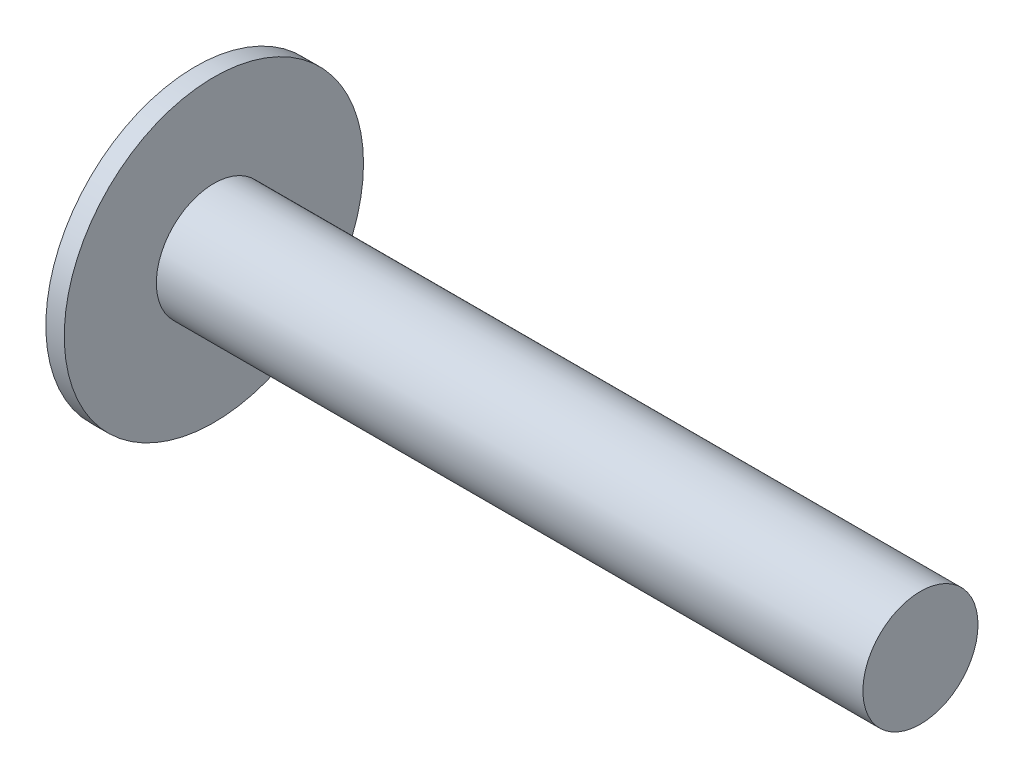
from build123d import *

# Parameters (mm, degrees)
SKETCH2_W          = 3.374008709
SKETCH2_H          = 0.730872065
CUT_EXTRUDE1_DEPTH = 0.254


with BuildPart() as part:
    # Sketch1 → Revolve1 (revolve)
    with BuildSketch(Plane(origin=(0, 0, 0), x_dir=(1, 0, 0), z_dir=(0, 1, 0)), mode=Mode.PRIVATE) as revolve1_sk:
        Polygon((0, 0), (-19.490008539, 0), (-19.490008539, -2.54), (-19.998008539, -2.54), (-19.998008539, 1.5875), (-19.490008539, 1.5875), (0, 1.5875), align=None)
    revolve(revolve1_sk.sketch.rotate(Axis((0, 0, -1.5875), (-1, 0, 0)), 180), axis=Axis((0, 0, -1.5875), (-1, 0, 0)))

    # Sketch2 → Cut-Extrude1 (cut)
    with BuildSketch(Plane.ZY.offset(19.998008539)):
        with Locations((-1.687004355, -0.012747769)):
            Rectangle(SKETCH2_W, SKETCH2_H)
    extrude(amount=-CUT_EXTRUDE1_DEPTH, mode=Mode.SUBTRACT)


solid = part.part
